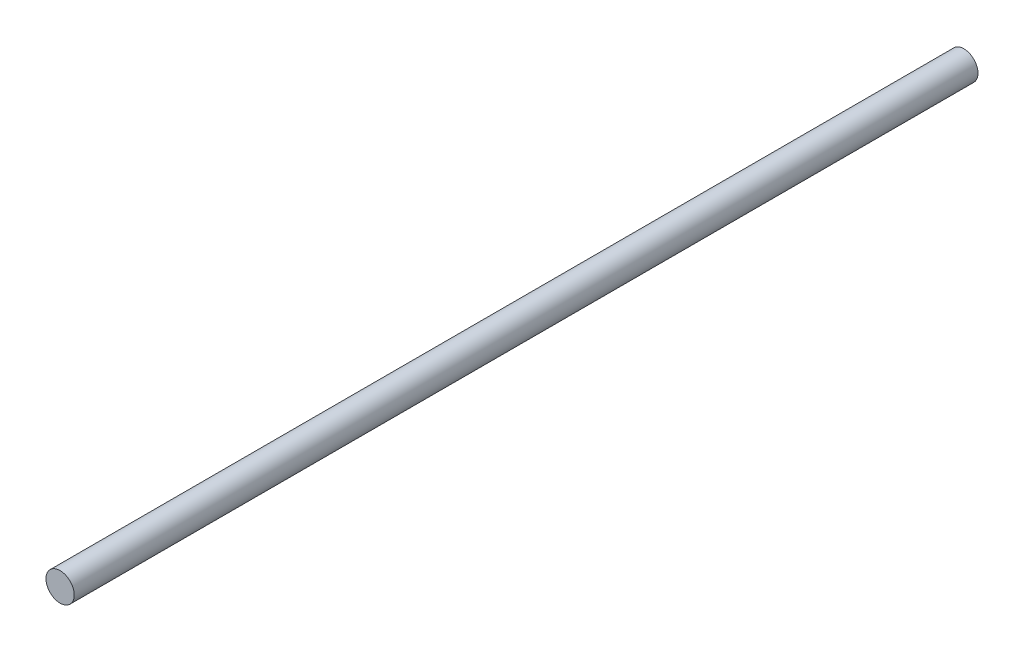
ISO-10303-21;
HEADER;
FILE_DESCRIPTION(('STEP AP214'),'2;1');
FILE_NAME('part.step','',(''),(''),'','','');
FILE_SCHEMA(('AUTOMOTIVE_DESIGN { 1 0 10303 214 1 1 1 1 }'));
ENDSEC;
DATA;
#1=APPLICATION_CONTEXT('core data for automotive mechanical design processes');
#2=APPLICATION_PROTOCOL_DEFINITION('international standard','automotive_design',2000,#1);
#3=PRODUCT_CONTEXT('',#1,'mechanical');
#4=PRODUCT('Part','Part','',(#3));
#5=PRODUCT_RELATED_PRODUCT_CATEGORY('part','',(#4));
#6=PRODUCT_DEFINITION_FORMATION('','',#4);
#7=PRODUCT_DEFINITION_CONTEXT('part definition',#1,'design');
#8=PRODUCT_DEFINITION('design','',#6,#7);
#9=PRODUCT_DEFINITION_SHAPE('','',#8);
#10=(LENGTH_UNIT() NAMED_UNIT(*) SI_UNIT(.MILLI.,.METRE.));
#11=(NAMED_UNIT(*) PLANE_ANGLE_UNIT() SI_UNIT($,.RADIAN.));
#12=(NAMED_UNIT(*) SI_UNIT($,.STERADIAN.) SOLID_ANGLE_UNIT());
#13=UNCERTAINTY_MEASURE_WITH_UNIT(LENGTH_MEASURE(1.E-05),#10,'distance_accuracy_value','');
#14=(GEOMETRIC_REPRESENTATION_CONTEXT(3) GLOBAL_UNCERTAINTY_ASSIGNED_CONTEXT((#13)) GLOBAL_UNIT_ASSIGNED_CONTEXT((#10,
#11,#12)) REPRESENTATION_CONTEXT('',''));
#15=CARTESIAN_POINT('',(0.,0.,0.));
#16=DIRECTION('',(0.,0.,1.));
#17=DIRECTION('',(1.,0.,0.));
#18=AXIS2_PLACEMENT_3D('',#15,#16,#17);
#19=CARTESIAN_POINT('',(0.,0.,320.));
#20=DIRECTION('',(0.,0.,-1.));
#21=DIRECTION('',(-1.,0.,0.));
#22=AXIS2_PLACEMENT_3D('',#19,#20,#21);
#23=CYLINDRICAL_SURFACE('',#22,5.);
#24=CARTESIAN_POINT('',(0.,0.,320.));
#25=DIRECTION('',(0.,0.,1.));
#26=DIRECTION('',(1.,0.,0.));
#27=AXIS2_PLACEMENT_3D('',#24,#25,#26);
#28=CIRCLE('',#27,5.);
#29=CARTESIAN_POINT('',(5.,0.,320.));
#30=VERTEX_POINT('',#29);
#31=EDGE_CURVE('E8',#30,#30,#28,.T.);
#32=ORIENTED_EDGE('',*,*,#31,.F.);
#33=EDGE_LOOP('',(#32));
#34=FACE_BOUND('',#33,.T.);
#35=CARTESIAN_POINT('',(0.,0.,0.));
#36=DIRECTION('',(0.,0.,1.));
#37=DIRECTION('',(1.,0.,0.));
#38=AXIS2_PLACEMENT_3D('',#35,#36,#37);
#39=CIRCLE('',#38,5.);
#40=CARTESIAN_POINT('',(5.,0.,0.));
#41=VERTEX_POINT('',#40);
#42=EDGE_CURVE('E18',#41,#41,#39,.T.);
#43=ORIENTED_EDGE('',*,*,#42,.T.);
#44=EDGE_LOOP('',(#43));
#45=FACE_BOUND('',#44,.T.);
#46=ADVANCED_FACE('F12',(#34,#45),#23,.T.);
#47=CARTESIAN_POINT('',(0.,0.,320.));
#48=DIRECTION('',(0.,0.,1.));
#49=DIRECTION('',(1.,0.,0.));
#50=AXIS2_PLACEMENT_3D('',#47,#48,#49);
#51=PLANE('',#50);
#52=ORIENTED_EDGE('',*,*,#31,.T.);
#53=EDGE_LOOP('',(#52));
#54=FACE_BOUND('',#53,.T.);
#55=ADVANCED_FACE('F27',(#54),#51,.T.);
#56=CARTESIAN_POINT('',(0.,0.,0.));
#57=DIRECTION('',(0.,0.,1.));
#58=DIRECTION('',(1.,0.,0.));
#59=AXIS2_PLACEMENT_3D('',#56,#57,#58);
#60=PLANE('',#59);
#61=ORIENTED_EDGE('',*,*,#42,.F.);
#62=EDGE_LOOP('',(#61));
#63=FACE_BOUND('',#62,.T.);
#64=ADVANCED_FACE('F25',(#63),#60,.F.);
#65=CLOSED_SHELL('',(#46,#55,#64));
#66=MANIFOLD_SOLID_BREP('B1',#65);
#67=ADVANCED_BREP_SHAPE_REPRESENTATION('',(#18,#66),#14);
#68=SHAPE_DEFINITION_REPRESENTATION(#9,#67);
ENDSEC;
END-ISO-10303-21;
